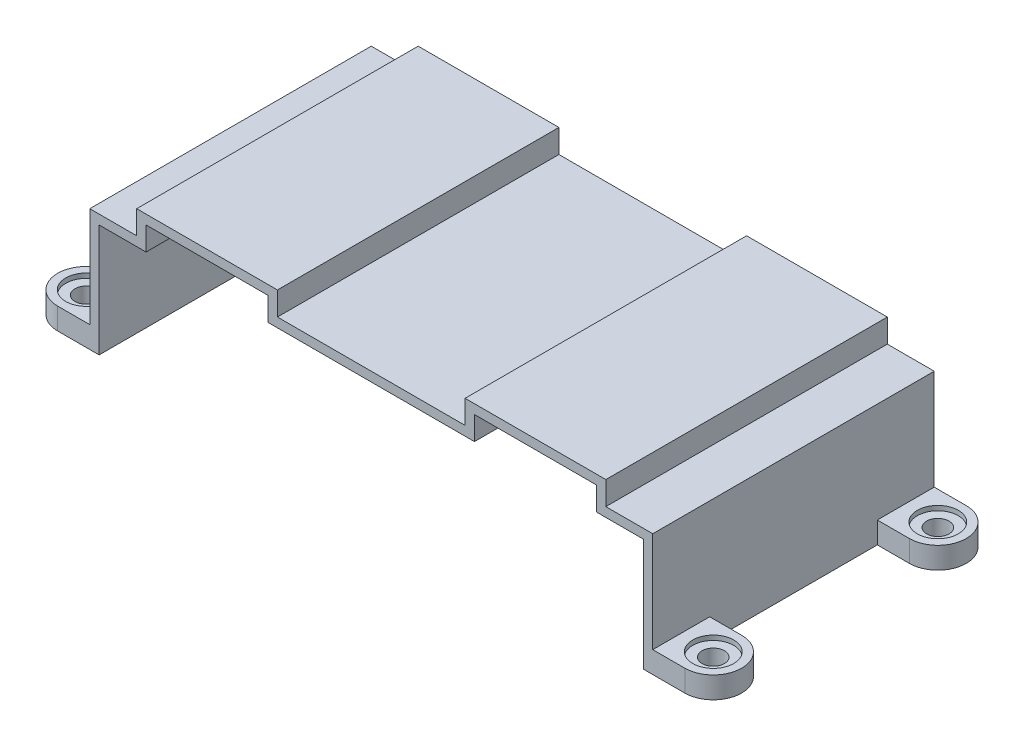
ISO-10303-21;
HEADER;
FILE_DESCRIPTION(('STEP AP214'),'2;1');
FILE_NAME('part.step','',(''),(''),'','','');
FILE_SCHEMA(('AUTOMOTIVE_DESIGN { 1 0 10303 214 1 1 1 1 }'));
ENDSEC;
DATA;
#1=APPLICATION_CONTEXT('core data for automotive mechanical design processes');
#2=APPLICATION_PROTOCOL_DEFINITION('international standard','automotive_design',2000,#1);
#3=PRODUCT_CONTEXT('',#1,'mechanical');
#4=PRODUCT('Part','Part','',(#3));
#5=PRODUCT_RELATED_PRODUCT_CATEGORY('part','',(#4));
#6=PRODUCT_DEFINITION_FORMATION('','',#4);
#7=PRODUCT_DEFINITION_CONTEXT('part definition',#1,'design');
#8=PRODUCT_DEFINITION('design','',#6,#7);
#9=PRODUCT_DEFINITION_SHAPE('','',#8);
#10=(LENGTH_UNIT() NAMED_UNIT(*) SI_UNIT(.MILLI.,.METRE.));
#11=(NAMED_UNIT(*) PLANE_ANGLE_UNIT() SI_UNIT($,.RADIAN.));
#12=(NAMED_UNIT(*) SI_UNIT($,.STERADIAN.) SOLID_ANGLE_UNIT());
#13=UNCERTAINTY_MEASURE_WITH_UNIT(LENGTH_MEASURE(1.E-05),#10,'distance_accuracy_value','');
#14=(GEOMETRIC_REPRESENTATION_CONTEXT(3) GLOBAL_UNCERTAINTY_ASSIGNED_CONTEXT((#13)) GLOBAL_UNIT_ASSIGNED_CONTEXT((#10,
#11,#12)) REPRESENTATION_CONTEXT('',''));
#15=CARTESIAN_POINT('',(0.,0.,0.));
#16=DIRECTION('',(0.,0.,1.));
#17=DIRECTION('',(1.,0.,0.));
#18=AXIS2_PLACEMENT_3D('',#15,#16,#17);
#19=CARTESIAN_POINT('',(-84.8733534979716,5.84200000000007,7.70474442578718));
#20=DIRECTION('',(0.,1.,0.));
#21=DIRECTION('',(-1.,0.,0.));
#22=AXIS2_PLACEMENT_3D('',#19,#20,#21);
#23=PLANE('',#22);
#24=DIRECTION('',(0.,0.,-1.));
#25=VECTOR('',#24,1.);
#26=CARTESIAN_POINT('',(-76.2,5.84200000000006,0.));
#27=LINE('',#26,#25);
#28=CARTESIAN_POINT('',(-76.2,5.84200000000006,15.4094888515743));
#29=VERTEX_POINT('',#28);
#30=CARTESIAN_POINT('',(-76.2,5.84200000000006,0.));
#31=VERTEX_POINT('',#30);
#32=EDGE_CURVE('E319',#29,#31,#27,.T.);
#33=ORIENTED_EDGE('',*,*,#32,.T.);
#34=DIRECTION('',(-1.,0.,0.));
#35=VECTOR('',#34,1.);
#36=CARTESIAN_POINT('',(-76.2,5.84200000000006,0.));
#37=LINE('',#36,#35);
#38=CARTESIAN_POINT('',(-84.8733534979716,5.84200000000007,0.));
#39=VERTEX_POINT('',#38);
#40=EDGE_CURVE('E328',#31,#39,#37,.T.);
#41=ORIENTED_EDGE('',*,*,#40,.T.);
#42=CARTESIAN_POINT('',(-84.8733534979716,5.84200000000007,7.70474442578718));
#43=DIRECTION('',(0.,1.,0.));
#44=DIRECTION('',(-1.,0.,0.));
#45=AXIS2_PLACEMENT_3D('',#42,#43,#44);
#46=CIRCLE('',#45,7.70474442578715);
#47=CARTESIAN_POINT('',(-84.8733534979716,5.84200000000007,15.4094888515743));
#48=VERTEX_POINT('',#47);
#49=EDGE_CURVE('E326',#39,#48,#46,.T.);
#50=ORIENTED_EDGE('',*,*,#49,.T.);
#51=DIRECTION('',(1.,0.,0.));
#52=VECTOR('',#51,1.);
#53=CARTESIAN_POINT('',(-76.2,5.84200000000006,15.4094888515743));
#54=LINE('',#53,#52);
#55=EDGE_CURVE('E322',#48,#29,#54,.T.);
#56=ORIENTED_EDGE('',*,*,#55,.T.);
#57=EDGE_LOOP('',(#33,#41,#50,#56));
#58=FACE_BOUND('',#57,.T.);
#59=CARTESIAN_POINT('',(-84.8733534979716,5.84200000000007,7.70474442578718));
#60=DIRECTION('',(0.,-1.,0.));
#61=DIRECTION('',(-1.,0.,0.));
#62=AXIS2_PLACEMENT_3D('',#59,#60,#61);
#63=CIRCLE('',#62,5.53458428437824);
#64=CARTESIAN_POINT('',(-90.4079377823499,5.84200000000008,7.70474442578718));
#65=VERTEX_POINT('',#64);
#66=EDGE_CURVE('E312',#65,#65,#63,.T.);
#67=ORIENTED_EDGE('',*,*,#66,.T.);
#68=EDGE_LOOP('',(#67));
#69=FACE_BOUND('',#68,.T.);
#70=ADVANCED_FACE('F31',(#58,#69),#23,.T.);
#71=CARTESIAN_POINT('',(-76.2,33.02,76.2));
#72=DIRECTION('',(1.,0.,0.));
#73=DIRECTION('',(0.,1.,0.));
#74=AXIS2_PLACEMENT_3D('',#71,#72,#73);
#75=PLANE('',#74);
#76=DIRECTION('',(0.,-1.,0.));
#77=VECTOR('',#76,1.);
#78=CARTESIAN_POINT('',(-76.2,5.84200000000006,15.4094888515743));
#79=LINE('',#78,#77);
#80=CARTESIAN_POINT('',(-76.2,0.,15.4094888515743));
#81=VERTEX_POINT('',#80);
#82=EDGE_CURVE('E330',#29,#81,#79,.T.);
#83=ORIENTED_EDGE('',*,*,#82,.T.);
#84=DIRECTION('',(0.,0.,-1.));
#85=VECTOR('',#84,1.);
#86=CARTESIAN_POINT('',(-76.2,0.,76.2));
#87=LINE('',#86,#85);
#88=CARTESIAN_POINT('',(-76.2,0.,60.7905111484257));
#89=VERTEX_POINT('',#88);
#90=EDGE_CURVE('E439',#89,#81,#87,.T.);
#91=ORIENTED_EDGE('',*,*,#90,.F.);
#92=DIRECTION('',(0.,-1.,0.));
#93=VECTOR('',#92,1.);
#94=CARTESIAN_POINT('',(-76.2,5.84200000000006,60.7905111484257));
#95=LINE('',#94,#93);
#96=CARTESIAN_POINT('',(-76.2,5.84200000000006,60.7905111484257));
#97=VERTEX_POINT('',#96);
#98=EDGE_CURVE('E627',#97,#89,#95,.T.);
#99=ORIENTED_EDGE('',*,*,#98,.F.);
#100=DIRECTION('',(0.,0.,1.));
#101=VECTOR('',#100,1.);
#102=CARTESIAN_POINT('',(-76.2,5.84200000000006,76.2));
#103=LINE('',#102,#101);
#104=CARTESIAN_POINT('',(-76.2,5.84200000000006,76.2));
#105=VERTEX_POINT('',#104);
#106=EDGE_CURVE('E623',#97,#105,#103,.T.);
#107=ORIENTED_EDGE('',*,*,#106,.T.);
#108=DIRECTION('',(0.,-1.,0.));
#109=VECTOR('',#108,1.);
#110=CARTESIAN_POINT('',(-76.2,33.02,76.2));
#111=LINE('',#110,#109);
#112=CARTESIAN_POINT('',(-76.2,33.02,76.2));
#113=VERTEX_POINT('',#112);
#114=EDGE_CURVE('E456',#113,#105,#111,.T.);
#115=ORIENTED_EDGE('',*,*,#114,.F.);
#116=DIRECTION('',(0.,0.,-1.));
#117=VECTOR('',#116,1.);
#118=CARTESIAN_POINT('',(-76.2,33.02,76.2));
#119=LINE('',#118,#117);
#120=CARTESIAN_POINT('',(-76.2,33.02,0.));
#121=VERTEX_POINT('',#120);
#122=EDGE_CURVE('E444',#113,#121,#119,.T.);
#123=ORIENTED_EDGE('',*,*,#122,.T.);
#124=DIRECTION('',(0.,-1.,0.));
#125=VECTOR('',#124,1.);
#126=CARTESIAN_POINT('',(-76.2,33.02,0.));
#127=LINE('',#126,#125);
#128=EDGE_CURVE('E498',#121,#31,#127,.T.);
#129=ORIENTED_EDGE('',*,*,#128,.T.);
#130=ORIENTED_EDGE('',*,*,#32,.F.);
#131=EDGE_LOOP('',(#83,#91,#99,#107,#115,#123,#129,#130));
#132=FACE_BOUND('',#131,.T.);
#133=ADVANCED_FACE('F409',(#132),#75,.F.);
#134=CARTESIAN_POINT('',(84.8733534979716,5.84200000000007,68.4952555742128));
#135=DIRECTION('',(0.,1.,0.));
#136=DIRECTION('',(1.,0.,0.));
#137=AXIS2_PLACEMENT_3D('',#134,#135,#136);
#138=PLANE('',#137);
#139=DIRECTION('',(0.,0.,1.));
#140=VECTOR('',#139,1.);
#141=CARTESIAN_POINT('',(76.2,5.84200000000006,76.2));
#142=LINE('',#141,#140);
#143=CARTESIAN_POINT('',(76.2,5.84200000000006,60.7905111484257));
#144=VERTEX_POINT('',#143);
#145=CARTESIAN_POINT('',(76.2,5.84200000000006,76.2));
#146=VERTEX_POINT('',#145);
#147=EDGE_CURVE('E355',#144,#146,#142,.T.);
#148=ORIENTED_EDGE('',*,*,#147,.T.);
#149=DIRECTION('',(1.,0.,0.));
#150=VECTOR('',#149,1.);
#151=CARTESIAN_POINT('',(76.2,5.84200000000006,76.2));
#152=LINE('',#151,#150);
#153=CARTESIAN_POINT('',(84.8733534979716,5.84200000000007,76.2));
#154=VERTEX_POINT('',#153);
#155=EDGE_CURVE('E357',#146,#154,#152,.T.);
#156=ORIENTED_EDGE('',*,*,#155,.T.);
#157=CARTESIAN_POINT('',(84.8733534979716,5.84200000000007,68.4952555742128));
#158=DIRECTION('',(0.,1.,0.));
#159=DIRECTION('',(1.,0.,0.));
#160=AXIS2_PLACEMENT_3D('',#157,#158,#159);
#161=CIRCLE('',#160,7.70474442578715);
#162=CARTESIAN_POINT('',(84.8733534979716,5.84200000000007,60.7905111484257));
#163=VERTEX_POINT('',#162);
#164=EDGE_CURVE('E354',#154,#163,#161,.T.);
#165=ORIENTED_EDGE('',*,*,#164,.T.);
#166=DIRECTION('',(-1.,0.,0.));
#167=VECTOR('',#166,1.);
#168=CARTESIAN_POINT('',(76.2,5.84200000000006,60.7905111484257));
#169=LINE('',#168,#167);
#170=EDGE_CURVE('E352',#163,#144,#169,.T.);
#171=ORIENTED_EDGE('',*,*,#170,.T.);
#172=EDGE_LOOP('',(#148,#156,#165,#171));
#173=FACE_BOUND('',#172,.T.);
#174=CARTESIAN_POINT('',(84.8733534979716,5.84200000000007,68.4952555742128));
#175=DIRECTION('',(0.,-1.,0.));
#176=DIRECTION('',(1.,0.,0.));
#177=AXIS2_PLACEMENT_3D('',#174,#175,#176);
#178=CIRCLE('',#177,5.53458428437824);
#179=CARTESIAN_POINT('',(90.4079377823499,5.84200000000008,68.4952555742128));
#180=VERTEX_POINT('',#179);
#181=EDGE_CURVE('E349',#180,#180,#178,.T.);
#182=ORIENTED_EDGE('',*,*,#181,.T.);
#183=EDGE_LOOP('',(#182));
#184=FACE_BOUND('',#183,.T.);
#185=ADVANCED_FACE('F415',(#173,#184),#138,.T.);
#186=CARTESIAN_POINT('',(76.2,33.02,76.2));
#187=DIRECTION('',(-1.,0.,0.));
#188=DIRECTION('',(0.,-1.,0.));
#189=AXIS2_PLACEMENT_3D('',#186,#187,#188);
#190=PLANE('',#189);
#191=DIRECTION('',(0.,0.,-1.));
#192=VECTOR('',#191,1.);
#193=CARTESIAN_POINT('',(76.2,0.,76.2));
#194=LINE('',#193,#192);
#195=CARTESIAN_POINT('',(76.2,0.,60.7905111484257));
#196=VERTEX_POINT('',#195);
#197=CARTESIAN_POINT('',(76.2,0.,15.4094888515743));
#198=VERTEX_POINT('',#197);
#199=EDGE_CURVE('E53',#196,#198,#194,.T.);
#200=ORIENTED_EDGE('',*,*,#199,.T.);
#201=DIRECTION('',(0.,-1.,0.));
#202=VECTOR('',#201,1.);
#203=CARTESIAN_POINT('',(76.2,5.84200000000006,15.4094888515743));
#204=LINE('',#203,#202);
#205=CARTESIAN_POINT('',(76.2,5.84200000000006,15.4094888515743));
#206=VERTEX_POINT('',#205);
#207=EDGE_CURVE('E48',#206,#198,#204,.T.);
#208=ORIENTED_EDGE('',*,*,#207,.F.);
#209=DIRECTION('',(0.,0.,-1.));
#210=VECTOR('',#209,1.);
#211=CARTESIAN_POINT('',(76.2,5.84200000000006,0.));
#212=LINE('',#211,#210);
#213=CARTESIAN_POINT('',(76.2,5.84200000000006,0.));
#214=VERTEX_POINT('',#213);
#215=EDGE_CURVE('E278',#206,#214,#212,.T.);
#216=ORIENTED_EDGE('',*,*,#215,.T.);
#217=DIRECTION('',(0.,1.,0.));
#218=VECTOR('',#217,1.);
#219=CARTESIAN_POINT('',(76.2,33.02,0.));
#220=LINE('',#219,#218);
#221=CARTESIAN_POINT('',(76.2,33.02,0.));
#222=VERTEX_POINT('',#221);
#223=EDGE_CURVE('E266',#214,#222,#220,.T.);
#224=ORIENTED_EDGE('',*,*,#223,.T.);
#225=DIRECTION('',(0.,0.,-1.));
#226=VECTOR('',#225,1.);
#227=CARTESIAN_POINT('',(76.2,33.02,76.2));
#228=LINE('',#227,#226);
#229=CARTESIAN_POINT('',(76.2,33.02,76.2));
#230=VERTEX_POINT('',#229);
#231=EDGE_CURVE('E536',#230,#222,#228,.T.);
#232=ORIENTED_EDGE('',*,*,#231,.F.);
#233=DIRECTION('',(0.,1.,0.));
#234=VECTOR('',#233,1.);
#235=CARTESIAN_POINT('',(76.2,33.02,76.2));
#236=LINE('',#235,#234);
#237=EDGE_CURVE('E614',#146,#230,#236,.T.);
#238=ORIENTED_EDGE('',*,*,#237,.F.);
#239=ORIENTED_EDGE('',*,*,#147,.F.);
#240=DIRECTION('',(0.,-1.,0.));
#241=VECTOR('',#240,1.);
#242=CARTESIAN_POINT('',(76.2,5.84200000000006,60.7905111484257));
#243=LINE('',#242,#241);
#244=EDGE_CURVE('E367',#144,#196,#243,.T.);
#245=ORIENTED_EDGE('',*,*,#244,.T.);
#246=EDGE_LOOP('',(#200,#208,#216,#224,#232,#238,#239,#245));
#247=FACE_BOUND('',#246,.T.);
#248=ADVANCED_FACE('F279',(#247),#190,.F.);
#249=CARTESIAN_POINT('',(25.4,39.37,76.2));
#250=DIRECTION('',(0.,-1.,0.));
#251=DIRECTION('',(0.,0.,-1.));
#252=AXIS2_PLACEMENT_3D('',#249,#250,#251);
#253=PLANE('',#252);
#254=DIRECTION('',(-1.,0.,0.));
#255=VECTOR('',#254,1.);
#256=CARTESIAN_POINT('',(25.4,39.37,0.));
#257=LINE('',#256,#255);
#258=CARTESIAN_POINT('',(63.5,39.37,0.));
#259=VERTEX_POINT('',#258);
#260=CARTESIAN_POINT('',(25.4,39.37,0.));
#261=VERTEX_POINT('',#260);
#262=EDGE_CURVE('E489',#259,#261,#257,.T.);
#263=ORIENTED_EDGE('',*,*,#262,.T.);
#264=DIRECTION('',(0.,0.,-1.));
#265=VECTOR('',#264,1.);
#266=CARTESIAN_POINT('',(25.4,39.37,76.2));
#267=LINE('',#266,#265);
#268=CARTESIAN_POINT('',(25.4,39.37,76.2));
#269=VERTEX_POINT('',#268);
#270=EDGE_CURVE('E11',#269,#261,#267,.T.);
#271=ORIENTED_EDGE('',*,*,#270,.F.);
#272=DIRECTION('',(-1.,0.,0.));
#273=VECTOR('',#272,1.);
#274=CARTESIAN_POINT('',(25.4,39.37,76.2));
#275=LINE('',#274,#273);
#276=CARTESIAN_POINT('',(63.5,39.37,76.2));
#277=VERTEX_POINT('',#276);
#278=EDGE_CURVE('E528',#277,#269,#275,.T.);
#279=ORIENTED_EDGE('',*,*,#278,.F.);
#280=DIRECTION('',(0.,0.,-1.));
#281=VECTOR('',#280,1.);
#282=CARTESIAN_POINT('',(63.5,39.37,76.2));
#283=LINE('',#282,#281);
#284=EDGE_CURVE('E529',#277,#259,#283,.T.);
#285=ORIENTED_EDGE('',*,*,#284,.T.);
#286=EDGE_LOOP('',(#263,#271,#279,#285));
#287=FACE_BOUND('',#286,.T.);
#288=ADVANCED_FACE('F33',(#287),#253,.F.);
#289=CARTESIAN_POINT('',(25.4,33.02,76.2));
#290=DIRECTION('',(1.,0.,0.));
#291=DIRECTION('',(0.,0.,-1.));
#292=AXIS2_PLACEMENT_3D('',#289,#290,#291);
#293=PLANE('',#292);
#294=DIRECTION('',(0.,-1.,0.));
#295=VECTOR('',#294,1.);
#296=CARTESIAN_POINT('',(25.4,33.02,0.));
#297=LINE('',#296,#295);
#298=CARTESIAN_POINT('',(25.4,33.02,0.));
#299=VERTEX_POINT('',#298);
#300=EDGE_CURVE('E483',#261,#299,#297,.T.);
#301=ORIENTED_EDGE('',*,*,#300,.T.);
#302=DIRECTION('',(0.,0.,-1.));
#303=VECTOR('',#302,1.);
#304=CARTESIAN_POINT('',(25.4,33.02,76.2));
#305=LINE('',#304,#303);
#306=CARTESIAN_POINT('',(25.4,33.02,76.2));
#307=VERTEX_POINT('',#306);
#308=EDGE_CURVE('E40',#307,#299,#305,.T.);
#309=ORIENTED_EDGE('',*,*,#308,.F.);
#310=DIRECTION('',(0.,-1.,0.));
#311=VECTOR('',#310,1.);
#312=CARTESIAN_POINT('',(25.4,33.02,76.2));
#313=LINE('',#312,#311);
#314=EDGE_CURVE('E655',#269,#307,#313,.T.);
#315=ORIENTED_EDGE('',*,*,#314,.F.);
#316=ORIENTED_EDGE('',*,*,#270,.T.);
#317=EDGE_LOOP('',(#301,#309,#315,#316));
#318=FACE_BOUND('',#317,.T.);
#319=ADVANCED_FACE('F699',(#318),#293,.F.);
#320=CARTESIAN_POINT('',(-25.4,33.02,76.2));
#321=DIRECTION('',(0.,-1.,0.));
#322=DIRECTION('',(1.,0.,0.));
#323=AXIS2_PLACEMENT_3D('',#320,#321,#322);
#324=PLANE('',#323);
#325=DIRECTION('',(-1.,0.,0.));
#326=VECTOR('',#325,1.);
#327=CARTESIAN_POINT('',(-25.4,33.02,0.));
#328=LINE('',#327,#326);
#329=CARTESIAN_POINT('',(-25.4,33.02,0.));
#330=VERTEX_POINT('',#329);
#331=EDGE_CURVE('E479',#299,#330,#328,.T.);
#332=ORIENTED_EDGE('',*,*,#331,.T.);
#333=DIRECTION('',(0.,0.,-1.));
#334=VECTOR('',#333,1.);
#335=CARTESIAN_POINT('',(-25.4,33.02,76.2));
#336=LINE('',#335,#334);
#337=CARTESIAN_POINT('',(-25.4,33.02,76.2));
#338=VERTEX_POINT('',#337);
#339=EDGE_CURVE('E470',#338,#330,#336,.T.);
#340=ORIENTED_EDGE('',*,*,#339,.F.);
#341=DIRECTION('',(-1.,0.,0.));
#342=VECTOR('',#341,1.);
#343=CARTESIAN_POINT('',(-25.4,33.02,76.2));
#344=LINE('',#343,#342);
#345=EDGE_CURVE('E480',#307,#338,#344,.T.);
#346=ORIENTED_EDGE('',*,*,#345,.F.);
#347=ORIENTED_EDGE('',*,*,#308,.T.);
#348=EDGE_LOOP('',(#332,#340,#346,#347));
#349=FACE_BOUND('',#348,.T.);
#350=ADVANCED_FACE('F477',(#349),#324,.F.);
#351=CARTESIAN_POINT('',(-25.4,33.02,76.2));
#352=DIRECTION('',(-1.,0.,0.));
#353=DIRECTION('',(0.,0.,1.));
#354=AXIS2_PLACEMENT_3D('',#351,#352,#353);
#355=PLANE('',#354);
#356=DIRECTION('',(0.,1.,0.));
#357=VECTOR('',#356,1.);
#358=CARTESIAN_POINT('',(-25.4,33.02,0.));
#359=LINE('',#358,#357);
#360=CARTESIAN_POINT('',(-25.4,39.37,0.));
#361=VERTEX_POINT('',#360);
#362=EDGE_CURVE('E485',#330,#361,#359,.T.);
#363=ORIENTED_EDGE('',*,*,#362,.T.);
#364=DIRECTION('',(0.,0.,-1.));
#365=VECTOR('',#364,1.);
#366=CARTESIAN_POINT('',(-25.4,39.37,76.2));
#367=LINE('',#366,#365);
#368=CARTESIAN_POINT('',(-25.4,39.37,76.2));
#369=VERTEX_POINT('',#368);
#370=EDGE_CURVE('E467',#369,#361,#367,.T.);
#371=ORIENTED_EDGE('',*,*,#370,.F.);
#372=DIRECTION('',(0.,1.,0.));
#373=VECTOR('',#372,1.);
#374=CARTESIAN_POINT('',(-25.4,33.02,76.2));
#375=LINE('',#374,#373);
#376=EDGE_CURVE('E658',#338,#369,#375,.T.);
#377=ORIENTED_EDGE('',*,*,#376,.F.);
#378=ORIENTED_EDGE('',*,*,#339,.T.);
#379=EDGE_LOOP('',(#363,#371,#377,#378));
#380=FACE_BOUND('',#379,.T.);
#381=ADVANCED_FACE('F696',(#380),#355,.F.);
#382=CARTESIAN_POINT('',(-63.5,39.37,76.2));
#383=DIRECTION('',(0.,-1.,0.));
#384=DIRECTION('',(1.,0.,0.));
#385=AXIS2_PLACEMENT_3D('',#382,#383,#384);
#386=PLANE('',#385);
#387=DIRECTION('',(-1.,0.,0.));
#388=VECTOR('',#387,1.);
#389=CARTESIAN_POINT('',(-63.5,39.37,0.));
#390=LINE('',#389,#388);
#391=CARTESIAN_POINT('',(-63.5,39.37,0.));
#392=VERTEX_POINT('',#391);
#393=EDGE_CURVE('E487',#361,#392,#390,.T.);
#394=ORIENTED_EDGE('',*,*,#393,.T.);
#395=DIRECTION('',(0.,0.,-1.));
#396=VECTOR('',#395,1.);
#397=CARTESIAN_POINT('',(-63.5,39.37,76.2));
#398=LINE('',#397,#396);
#399=CARTESIAN_POINT('',(-63.5,39.37,76.2));
#400=VERTEX_POINT('',#399);
#401=EDGE_CURVE('E464',#400,#392,#398,.T.);
#402=ORIENTED_EDGE('',*,*,#401,.F.);
#403=DIRECTION('',(-1.,0.,0.));
#404=VECTOR('',#403,1.);
#405=CARTESIAN_POINT('',(-63.5,39.37,76.2));
#406=LINE('',#405,#404);
#407=EDGE_CURVE('E660',#369,#400,#406,.T.);
#408=ORIENTED_EDGE('',*,*,#407,.F.);
#409=ORIENTED_EDGE('',*,*,#370,.T.);
#410=EDGE_LOOP('',(#394,#402,#408,#409));
#411=FACE_BOUND('',#410,.T.);
#412=ADVANCED_FACE('F691',(#411),#386,.F.);
#413=CARTESIAN_POINT('',(-63.5,39.37,76.2));
#414=DIRECTION('',(1.,0.,0.));
#415=DIRECTION('',(0.,0.,-1.));
#416=AXIS2_PLACEMENT_3D('',#413,#414,#415);
#417=PLANE('',#416);
#418=DIRECTION('',(0.,-1.,0.));
#419=VECTOR('',#418,1.);
#420=CARTESIAN_POINT('',(-63.5,39.37,0.));
#421=LINE('',#420,#419);
#422=CARTESIAN_POINT('',(-63.5,33.02,0.));
#423=VERTEX_POINT('',#422);
#424=EDGE_CURVE('E494',#392,#423,#421,.T.);
#425=ORIENTED_EDGE('',*,*,#424,.T.);
#426=DIRECTION('',(0.,0.,-1.));
#427=VECTOR('',#426,1.);
#428=CARTESIAN_POINT('',(-63.5,33.02,76.2));
#429=LINE('',#428,#427);
#430=CARTESIAN_POINT('',(-63.5,33.02,76.2));
#431=VERTEX_POINT('',#430);
#432=EDGE_CURVE('E448',#431,#423,#429,.T.);
#433=ORIENTED_EDGE('',*,*,#432,.F.);
#434=DIRECTION('',(0.,-1.,0.));
#435=VECTOR('',#434,1.);
#436=CARTESIAN_POINT('',(-63.5,39.37,76.2));
#437=LINE('',#436,#435);
#438=EDGE_CURVE('E662',#400,#431,#437,.T.);
#439=ORIENTED_EDGE('',*,*,#438,.F.);
#440=ORIENTED_EDGE('',*,*,#401,.T.);
#441=EDGE_LOOP('',(#425,#433,#439,#440));
#442=FACE_BOUND('',#441,.T.);
#443=ADVANCED_FACE('F688',(#442),#417,.F.);
#444=CARTESIAN_POINT('',(-76.2,33.02,76.2));
#445=DIRECTION('',(0.,-1.,0.));
#446=DIRECTION('',(0.,0.,-1.));
#447=AXIS2_PLACEMENT_3D('',#444,#445,#446);
#448=PLANE('',#447);
#449=DIRECTION('',(-1.,0.,0.));
#450=VECTOR('',#449,1.);
#451=CARTESIAN_POINT('',(-76.2,33.02,0.));
#452=LINE('',#451,#450);
#453=EDGE_CURVE('E496',#423,#121,#452,.T.);
#454=ORIENTED_EDGE('',*,*,#453,.T.);
#455=ORIENTED_EDGE('',*,*,#122,.F.);
#456=DIRECTION('',(-1.,0.,0.));
#457=VECTOR('',#456,1.);
#458=CARTESIAN_POINT('',(-76.2,33.02,76.2));
#459=LINE('',#458,#457);
#460=EDGE_CURVE('E664',#431,#113,#459,.T.);
#461=ORIENTED_EDGE('',*,*,#460,.F.);
#462=ORIENTED_EDGE('',*,*,#432,.T.);
#463=EDGE_LOOP('',(#454,#455,#461,#462));
#464=FACE_BOUND('',#463,.T.);
#465=ADVANCED_FACE('F684',(#464),#448,.F.);
#466=CARTESIAN_POINT('',(-76.2,0.,76.2));
#467=DIRECTION('',(0.,1.,0.));
#468=DIRECTION('',(-1.,0.,0.));
#469=AXIS2_PLACEMENT_3D('',#466,#467,#468);
#470=PLANE('',#469);
#471=CARTESIAN_POINT('',(-84.8733534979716,0.,7.70474442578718));
#472=DIRECTION('',(0.,1.,0.));
#473=DIRECTION('',(-1.,0.,0.));
#474=AXIS2_PLACEMENT_3D('',#471,#472,#473);
#475=CIRCLE('',#474,3.02259999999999);
#476=CARTESIAN_POINT('',(-87.8959534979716,0.,7.70474442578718));
#477=VERTEX_POINT('',#476);
#478=EDGE_CURVE('E309',#477,#477,#475,.T.);
#479=ORIENTED_EDGE('',*,*,#478,.T.);
#480=EDGE_LOOP('',(#479));
#481=FACE_BOUND('',#480,.T.);
#482=CARTESIAN_POINT('',(-84.8733534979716,0.,68.4952555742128));
#483=DIRECTION('',(0.,1.,0.));
#484=DIRECTION('',(-1.,0.,0.));
#485=AXIS2_PLACEMENT_3D('',#482,#483,#484);
#486=CIRCLE('',#485,3.02259999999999);
#487=CARTESIAN_POINT('',(-87.8959534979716,0.,68.4952555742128));
#488=VERTEX_POINT('',#487);
#489=EDGE_CURVE('E1032',#488,#488,#486,.T.);
#490=ORIENTED_EDGE('',*,*,#489,.T.);
#491=EDGE_LOOP('',(#490));
#492=FACE_BOUND('',#491,.T.);
#493=DIRECTION('',(1.,0.,0.));
#494=VECTOR('',#493,1.);
#495=CARTESIAN_POINT('',(-76.2,0.,0.));
#496=LINE('',#495,#494);
#497=CARTESIAN_POINT('',(-84.8733534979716,0.,0.));
#498=VERTEX_POINT('',#497);
#499=CARTESIAN_POINT('',(-73.66,0.,0.));
#500=VERTEX_POINT('',#499);
#501=EDGE_CURVE('E500',#498,#500,#496,.T.);
#502=ORIENTED_EDGE('',*,*,#501,.T.);
#503=DIRECTION('',(0.,0.,-1.));
#504=VECTOR('',#503,1.);
#505=CARTESIAN_POINT('',(-73.66,0.,76.2));
#506=LINE('',#505,#504);
#507=CARTESIAN_POINT('',(-73.66,0.,76.2));
#508=VERTEX_POINT('',#507);
#509=EDGE_CURVE('E445',#508,#500,#506,.T.);
#510=ORIENTED_EDGE('',*,*,#509,.F.);
#511=DIRECTION('',(1.,0.,0.));
#512=VECTOR('',#511,1.);
#513=CARTESIAN_POINT('',(-76.2,0.,76.2));
#514=LINE('',#513,#512);
#515=CARTESIAN_POINT('',(-84.8733534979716,0.,76.2));
#516=VERTEX_POINT('',#515);
#517=EDGE_CURVE('E667',#516,#508,#514,.T.);
#518=ORIENTED_EDGE('',*,*,#517,.F.);
#519=CARTESIAN_POINT('',(-84.8733534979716,0.,68.4952555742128));
#520=DIRECTION('',(0.,-1.,0.));
#521=DIRECTION('',(-1.,0.,0.));
#522=AXIS2_PLACEMENT_3D('',#519,#520,#521);
#523=CIRCLE('',#522,7.70474442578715);
#524=CARTESIAN_POINT('',(-84.8733534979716,0.,60.7905111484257));
#525=VERTEX_POINT('',#524);
#526=EDGE_CURVE('E624',#516,#525,#523,.T.);
#527=ORIENTED_EDGE('',*,*,#526,.T.);
#528=DIRECTION('',(1.,0.,0.));
#529=VECTOR('',#528,1.);
#530=CARTESIAN_POINT('',(-76.2,0.,60.7905111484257));
#531=LINE('',#530,#529);
#532=EDGE_CURVE('E442',#525,#89,#531,.T.);
#533=ORIENTED_EDGE('',*,*,#532,.T.);
#534=ORIENTED_EDGE('',*,*,#90,.T.);
#535=DIRECTION('',(1.,0.,0.));
#536=VECTOR('',#535,1.);
#537=CARTESIAN_POINT('',(-76.2,0.,15.4094888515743));
#538=LINE('',#537,#536);
#539=CARTESIAN_POINT('',(-84.8733534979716,0.,15.4094888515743));
#540=VERTEX_POINT('',#539);
#541=EDGE_CURVE('E316',#540,#81,#538,.T.);
#542=ORIENTED_EDGE('',*,*,#541,.F.);
#543=CARTESIAN_POINT('',(-84.8733534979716,0.,7.70474442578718));
#544=DIRECTION('',(0.,1.,0.));
#545=DIRECTION('',(-1.,0.,0.));
#546=AXIS2_PLACEMENT_3D('',#543,#544,#545);
#547=CIRCLE('',#546,7.70474442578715);
#548=EDGE_CURVE('E323',#498,#540,#547,.T.);
#549=ORIENTED_EDGE('',*,*,#548,.F.);
#550=EDGE_LOOP('',(#502,#510,#518,#527,#533,#534,#542,#549));
#551=FACE_BOUND('',#550,.T.);
#552=ADVANCED_FACE('F436',(#481,#492,#551),#470,.F.);
#553=CARTESIAN_POINT('',(-73.66,30.48,76.2));
#554=DIRECTION('',(-1.,0.,0.));
#555=DIRECTION('',(0.,0.,1.));
#556=AXIS2_PLACEMENT_3D('',#553,#554,#555);
#557=PLANE('',#556);
#558=DIRECTION('',(0.,1.,0.));
#559=VECTOR('',#558,1.);
#560=CARTESIAN_POINT('',(-73.66,30.48,0.));
#561=LINE('',#560,#559);
#562=CARTESIAN_POINT('',(-73.66,30.48,0.));
#563=VERTEX_POINT('',#562);
#564=EDGE_CURVE('E502',#500,#563,#561,.T.);
#565=ORIENTED_EDGE('',*,*,#564,.T.);
#566=DIRECTION('',(0.,0.,-1.));
#567=VECTOR('',#566,1.);
#568=CARTESIAN_POINT('',(-73.66,30.48,76.2));
#569=LINE('',#568,#567);
#570=CARTESIAN_POINT('',(-73.66,30.48,76.2));
#571=VERTEX_POINT('',#570);
#572=EDGE_CURVE('E451',#571,#563,#569,.T.);
#573=ORIENTED_EDGE('',*,*,#572,.F.);
#574=DIRECTION('',(0.,1.,0.));
#575=VECTOR('',#574,1.);
#576=CARTESIAN_POINT('',(-73.66,30.48,76.2));
#577=LINE('',#576,#575);
#578=EDGE_CURVE('E669',#508,#571,#577,.T.);
#579=ORIENTED_EDGE('',*,*,#578,.F.);
#580=ORIENTED_EDGE('',*,*,#509,.T.);
#581=EDGE_LOOP('',(#565,#573,#579,#580));
#582=FACE_BOUND('',#581,.T.);
#583=ADVANCED_FACE('F672',(#582),#557,.F.);
#584=CARTESIAN_POINT('',(-73.66,30.48,76.2));
#585=DIRECTION('',(0.,1.,0.));
#586=DIRECTION('',(0.,0.,1.));
#587=AXIS2_PLACEMENT_3D('',#584,#585,#586);
#588=PLANE('',#587);
#589=DIRECTION('',(1.,0.,0.));
#590=VECTOR('',#589,1.);
#591=CARTESIAN_POINT('',(-73.66,30.48,0.));
#592=LINE('',#591,#590);
#593=CARTESIAN_POINT('',(-60.96,30.48,0.));
#594=VERTEX_POINT('',#593);
#595=EDGE_CURVE('E504',#563,#594,#592,.T.);
#596=ORIENTED_EDGE('',*,*,#595,.T.);
#597=DIRECTION('',(0.,0.,-1.));
#598=VECTOR('',#597,1.);
#599=CARTESIAN_POINT('',(-60.96,30.48,76.2));
#600=LINE('',#599,#598);
#601=CARTESIAN_POINT('',(-60.96,30.48,76.2));
#602=VERTEX_POINT('',#601);
#603=EDGE_CURVE('E566',#602,#594,#600,.T.);
#604=ORIENTED_EDGE('',*,*,#603,.F.);
#605=DIRECTION('',(1.,0.,0.));
#606=VECTOR('',#605,1.);
#607=CARTESIAN_POINT('',(-73.66,30.48,76.2));
#608=LINE('',#607,#606);
#609=EDGE_CURVE('E575',#571,#602,#608,.T.);
#610=ORIENTED_EDGE('',*,*,#609,.F.);
#611=ORIENTED_EDGE('',*,*,#572,.T.);
#612=EDGE_LOOP('',(#596,#604,#610,#611));
#613=FACE_BOUND('',#612,.T.);
#614=ADVANCED_FACE('F573',(#613),#588,.F.);
#615=CARTESIAN_POINT('',(-60.96,36.83,76.2));
#616=DIRECTION('',(-1.,0.,0.));
#617=DIRECTION('',(0.,0.,1.));
#618=AXIS2_PLACEMENT_3D('',#615,#616,#617);
#619=PLANE('',#618);
#620=DIRECTION('',(0.,1.,0.));
#621=VECTOR('',#620,1.);
#622=CARTESIAN_POINT('',(-60.96,36.83,0.));
#623=LINE('',#622,#621);
#624=CARTESIAN_POINT('',(-60.96,36.83,0.));
#625=VERTEX_POINT('',#624);
#626=EDGE_CURVE('E506',#594,#625,#623,.T.);
#627=ORIENTED_EDGE('',*,*,#626,.T.);
#628=DIRECTION('',(0.,0.,-1.));
#629=VECTOR('',#628,1.);
#630=CARTESIAN_POINT('',(-60.96,36.83,76.2));
#631=LINE('',#630,#629);
#632=CARTESIAN_POINT('',(-60.96,36.83,76.2));
#633=VERTEX_POINT('',#632);
#634=EDGE_CURVE('E563',#633,#625,#631,.T.);
#635=ORIENTED_EDGE('',*,*,#634,.F.);
#636=DIRECTION('',(0.,1.,0.));
#637=VECTOR('',#636,1.);
#638=CARTESIAN_POINT('',(-60.96,36.83,76.2));
#639=LINE('',#638,#637);
#640=EDGE_CURVE('E594',#602,#633,#639,.T.);
#641=ORIENTED_EDGE('',*,*,#640,.F.);
#642=ORIENTED_EDGE('',*,*,#603,.T.);
#643=EDGE_LOOP('',(#627,#635,#641,#642));
#644=FACE_BOUND('',#643,.T.);
#645=ADVANCED_FACE('F584',(#644),#619,.F.);
#646=CARTESIAN_POINT('',(-60.96,36.83,76.2));
#647=DIRECTION('',(0.,1.,0.));
#648=DIRECTION('',(-1.,0.,0.));
#649=AXIS2_PLACEMENT_3D('',#646,#647,#648);
#650=PLANE('',#649);
#651=DIRECTION('',(1.,0.,0.));
#652=VECTOR('',#651,1.);
#653=CARTESIAN_POINT('',(-60.96,36.83,0.));
#654=LINE('',#653,#652);
#655=CARTESIAN_POINT('',(-27.94,36.83,0.));
#656=VERTEX_POINT('',#655);
#657=EDGE_CURVE('E508',#625,#656,#654,.T.);
#658=ORIENTED_EDGE('',*,*,#657,.T.);
#659=DIRECTION('',(0.,0.,-1.));
#660=VECTOR('',#659,1.);
#661=CARTESIAN_POINT('',(-27.94,36.83,76.2));
#662=LINE('',#661,#660);
#663=CARTESIAN_POINT('',(-27.94,36.83,76.2));
#664=VERTEX_POINT('',#663);
#665=EDGE_CURVE('E560',#664,#656,#662,.T.);
#666=ORIENTED_EDGE('',*,*,#665,.F.);
#667=DIRECTION('',(1.,0.,0.));
#668=VECTOR('',#667,1.);
#669=CARTESIAN_POINT('',(-60.96,36.83,76.2));
#670=LINE('',#669,#668);
#671=EDGE_CURVE('E590',#633,#664,#670,.T.);
#672=ORIENTED_EDGE('',*,*,#671,.F.);
#673=ORIENTED_EDGE('',*,*,#634,.T.);
#674=EDGE_LOOP('',(#658,#666,#672,#673));
#675=FACE_BOUND('',#674,.T.);
#676=ADVANCED_FACE('F588',(#675),#650,.F.);
#677=CARTESIAN_POINT('',(-27.94,30.48,76.2));
#678=DIRECTION('',(1.,0.,0.));
#679=DIRECTION('',(0.,0.,-1.));
#680=AXIS2_PLACEMENT_3D('',#677,#678,#679);
#681=PLANE('',#680);
#682=DIRECTION('',(0.,-1.,0.));
#683=VECTOR('',#682,1.);
#684=CARTESIAN_POINT('',(-27.94,30.48,0.));
#685=LINE('',#684,#683);
#686=CARTESIAN_POINT('',(-27.94,30.48,0.));
#687=VERTEX_POINT('',#686);
#688=EDGE_CURVE('E510',#656,#687,#685,.T.);
#689=ORIENTED_EDGE('',*,*,#688,.T.);
#690=DIRECTION('',(0.,0.,-1.));
#691=VECTOR('',#690,1.);
#692=CARTESIAN_POINT('',(-27.94,30.48,76.2));
#693=LINE('',#692,#691);
#694=CARTESIAN_POINT('',(-27.94,30.48,76.2));
#695=VERTEX_POINT('',#694);
#696=EDGE_CURVE('E557',#695,#687,#693,.T.);
#697=ORIENTED_EDGE('',*,*,#696,.F.);
#698=DIRECTION('',(0.,-1.,0.));
#699=VECTOR('',#698,1.);
#700=CARTESIAN_POINT('',(-27.94,30.48,76.2));
#701=LINE('',#700,#699);
#702=EDGE_CURVE('E593',#664,#695,#701,.T.);
#703=ORIENTED_EDGE('',*,*,#702,.F.);
#704=ORIENTED_EDGE('',*,*,#665,.T.);
#705=EDGE_LOOP('',(#689,#697,#703,#704));
#706=FACE_BOUND('',#705,.T.);
#707=ADVANCED_FACE('F749',(#706),#681,.F.);
#708=CARTESIAN_POINT('',(-27.94,30.48,76.2));
#709=DIRECTION('',(0.,1.,0.));
#710=DIRECTION('',(0.,0.,1.));
#711=AXIS2_PLACEMENT_3D('',#708,#709,#710);
#712=PLANE('',#711);
#713=DIRECTION('',(1.,0.,0.));
#714=VECTOR('',#713,1.);
#715=CARTESIAN_POINT('',(-27.94,30.48,0.));
#716=LINE('',#715,#714);
#717=CARTESIAN_POINT('',(27.94,30.48,0.));
#718=VERTEX_POINT('',#717);
#719=EDGE_CURVE('E512',#687,#718,#716,.T.);
#720=ORIENTED_EDGE('',*,*,#719,.T.);
#721=DIRECTION('',(0.,0.,-1.));
#722=VECTOR('',#721,1.);
#723=CARTESIAN_POINT('',(27.94,30.48,76.2));
#724=LINE('',#723,#722);
#725=CARTESIAN_POINT('',(27.94,30.48,76.2));
#726=VERTEX_POINT('',#725);
#727=EDGE_CURVE('E554',#726,#718,#724,.T.);
#728=ORIENTED_EDGE('',*,*,#727,.F.);
#729=DIRECTION('',(1.,0.,0.));
#730=VECTOR('',#729,1.);
#731=CARTESIAN_POINT('',(-27.94,30.48,76.2));
#732=LINE('',#731,#730);
#733=EDGE_CURVE('E596',#695,#726,#732,.T.);
#734=ORIENTED_EDGE('',*,*,#733,.F.);
#735=ORIENTED_EDGE('',*,*,#696,.T.);
#736=EDGE_LOOP('',(#720,#728,#734,#735));
#737=FACE_BOUND('',#736,.T.);
#738=ADVANCED_FACE('F745',(#737),#712,.F.);
#739=CARTESIAN_POINT('',(27.94,30.48,76.2));
#740=DIRECTION('',(-1.,0.,0.));
#741=DIRECTION('',(0.,0.,1.));
#742=AXIS2_PLACEMENT_3D('',#739,#740,#741);
#743=PLANE('',#742);
#744=DIRECTION('',(0.,1.,0.));
#745=VECTOR('',#744,1.);
#746=CARTESIAN_POINT('',(27.94,30.48,0.));
#747=LINE('',#746,#745);
#748=CARTESIAN_POINT('',(27.94,36.83,0.));
#749=VERTEX_POINT('',#748);
#750=EDGE_CURVE('E514',#718,#749,#747,.T.);
#751=ORIENTED_EDGE('',*,*,#750,.T.);
#752=DIRECTION('',(0.,0.,-1.));
#753=VECTOR('',#752,1.);
#754=CARTESIAN_POINT('',(27.94,36.83,76.2));
#755=LINE('',#754,#753);
#756=CARTESIAN_POINT('',(27.94,36.83,76.2));
#757=VERTEX_POINT('',#756);
#758=EDGE_CURVE('E551',#757,#749,#755,.T.);
#759=ORIENTED_EDGE('',*,*,#758,.F.);
#760=DIRECTION('',(0.,1.,0.));
#761=VECTOR('',#760,1.);
#762=CARTESIAN_POINT('',(27.94,30.48,76.2));
#763=LINE('',#762,#761);
#764=EDGE_CURVE('E602',#726,#757,#763,.T.);
#765=ORIENTED_EDGE('',*,*,#764,.F.);
#766=ORIENTED_EDGE('',*,*,#727,.T.);
#767=EDGE_LOOP('',(#751,#759,#765,#766));
#768=FACE_BOUND('',#767,.T.);
#769=ADVANCED_FACE('F741',(#768),#743,.F.);
#770=CARTESIAN_POINT('',(27.94,36.83,76.2));
#771=DIRECTION('',(0.,1.,0.));
#772=DIRECTION('',(-1.,0.,0.));
#773=AXIS2_PLACEMENT_3D('',#770,#771,#772);
#774=PLANE('',#773);
#775=DIRECTION('',(1.,0.,0.));
#776=VECTOR('',#775,1.);
#777=CARTESIAN_POINT('',(27.94,36.83,0.));
#778=LINE('',#777,#776);
#779=CARTESIAN_POINT('',(60.96,36.83,0.));
#780=VERTEX_POINT('',#779);
#781=EDGE_CURVE('E516',#749,#780,#778,.T.);
#782=ORIENTED_EDGE('',*,*,#781,.T.);
#783=DIRECTION('',(0.,0.,-1.));
#784=VECTOR('',#783,1.);
#785=CARTESIAN_POINT('',(60.96,36.83,76.2));
#786=LINE('',#785,#784);
#787=CARTESIAN_POINT('',(60.96,36.83,76.2));
#788=VERTEX_POINT('',#787);
#789=EDGE_CURVE('E548',#788,#780,#786,.T.);
#790=ORIENTED_EDGE('',*,*,#789,.F.);
#791=DIRECTION('',(1.,0.,0.));
#792=VECTOR('',#791,1.);
#793=CARTESIAN_POINT('',(27.94,36.83,76.2));
#794=LINE('',#793,#792);
#795=EDGE_CURVE('E604',#757,#788,#794,.T.);
#796=ORIENTED_EDGE('',*,*,#795,.F.);
#797=ORIENTED_EDGE('',*,*,#758,.T.);
#798=EDGE_LOOP('',(#782,#790,#796,#797));
#799=FACE_BOUND('',#798,.T.);
#800=ADVANCED_FACE('F737',(#799),#774,.F.);
#801=CARTESIAN_POINT('',(60.96,36.83,76.2));
#802=DIRECTION('',(1.,0.,0.));
#803=DIRECTION('',(0.,0.,-1.));
#804=AXIS2_PLACEMENT_3D('',#801,#802,#803);
#805=PLANE('',#804);
#806=DIRECTION('',(0.,-1.,0.));
#807=VECTOR('',#806,1.);
#808=CARTESIAN_POINT('',(60.96,36.83,0.));
#809=LINE('',#808,#807);
#810=CARTESIAN_POINT('',(60.96,30.48,0.));
#811=VERTEX_POINT('',#810);
#812=EDGE_CURVE('E518',#780,#811,#809,.T.);
#813=ORIENTED_EDGE('',*,*,#812,.T.);
#814=DIRECTION('',(0.,0.,-1.));
#815=VECTOR('',#814,1.);
#816=CARTESIAN_POINT('',(60.96,30.48,76.2));
#817=LINE('',#816,#815);
#818=CARTESIAN_POINT('',(60.96,30.48,76.2));
#819=VERTEX_POINT('',#818);
#820=EDGE_CURVE('E545',#819,#811,#817,.T.);
#821=ORIENTED_EDGE('',*,*,#820,.F.);
#822=DIRECTION('',(0.,-1.,0.));
#823=VECTOR('',#822,1.);
#824=CARTESIAN_POINT('',(60.96,36.83,76.2));
#825=LINE('',#824,#823);
#826=EDGE_CURVE('E606',#788,#819,#825,.T.);
#827=ORIENTED_EDGE('',*,*,#826,.F.);
#828=ORIENTED_EDGE('',*,*,#789,.T.);
#829=EDGE_LOOP('',(#813,#821,#827,#828));
#830=FACE_BOUND('',#829,.T.);
#831=ADVANCED_FACE('F733',(#830),#805,.F.);
#832=CARTESIAN_POINT('',(60.96,30.48,76.2));
#833=DIRECTION('',(0.,1.,0.));
#834=DIRECTION('',(0.,0.,1.));
#835=AXIS2_PLACEMENT_3D('',#832,#833,#834);
#836=PLANE('',#835);
#837=DIRECTION('',(1.,0.,0.));
#838=VECTOR('',#837,1.);
#839=CARTESIAN_POINT('',(60.96,30.48,0.));
#840=LINE('',#839,#838);
#841=CARTESIAN_POINT('',(73.66,30.48,0.));
#842=VERTEX_POINT('',#841);
#843=EDGE_CURVE('E520',#811,#842,#840,.T.);
#844=ORIENTED_EDGE('',*,*,#843,.T.);
#845=DIRECTION('',(0.,0.,-1.));
#846=VECTOR('',#845,1.);
#847=CARTESIAN_POINT('',(73.66,30.48,76.2));
#848=LINE('',#847,#846);
#849=CARTESIAN_POINT('',(73.66,30.48,76.2));
#850=VERTEX_POINT('',#849);
#851=EDGE_CURVE('E542',#850,#842,#848,.T.);
#852=ORIENTED_EDGE('',*,*,#851,.F.);
#853=DIRECTION('',(1.,0.,0.));
#854=VECTOR('',#853,1.);
#855=CARTESIAN_POINT('',(60.96,30.48,76.2));
#856=LINE('',#855,#854);
#857=EDGE_CURVE('E608',#819,#850,#856,.T.);
#858=ORIENTED_EDGE('',*,*,#857,.F.);
#859=ORIENTED_EDGE('',*,*,#820,.T.);
#860=EDGE_LOOP('',(#844,#852,#858,#859));
#861=FACE_BOUND('',#860,.T.);
#862=ADVANCED_FACE('F729',(#861),#836,.F.);
#863=CARTESIAN_POINT('',(73.66,30.48,76.2));
#864=DIRECTION('',(1.,0.,0.));
#865=DIRECTION('',(0.,0.,-1.));
#866=AXIS2_PLACEMENT_3D('',#863,#864,#865);
#867=PLANE('',#866);
#868=DIRECTION('',(0.,-1.,0.));
#869=VECTOR('',#868,1.);
#870=CARTESIAN_POINT('',(73.66,30.48,0.));
#871=LINE('',#870,#869);
#872=CARTESIAN_POINT('',(73.66,0.,0.));
#873=VERTEX_POINT('',#872);
#874=EDGE_CURVE('E522',#842,#873,#871,.T.);
#875=ORIENTED_EDGE('',*,*,#874,.T.);
#876=DIRECTION('',(0.,0.,-1.));
#877=VECTOR('',#876,1.);
#878=CARTESIAN_POINT('',(73.66,0.,76.2));
#879=LINE('',#878,#877);
#880=CARTESIAN_POINT('',(73.66,0.,76.2));
#881=VERTEX_POINT('',#880);
#882=EDGE_CURVE('E539',#881,#873,#879,.T.);
#883=ORIENTED_EDGE('',*,*,#882,.F.);
#884=DIRECTION('',(0.,-1.,0.));
#885=VECTOR('',#884,1.);
#886=CARTESIAN_POINT('',(73.66,30.48,76.2));
#887=LINE('',#886,#885);
#888=EDGE_CURVE('E610',#850,#881,#887,.T.);
#889=ORIENTED_EDGE('',*,*,#888,.F.);
#890=ORIENTED_EDGE('',*,*,#851,.T.);
#891=EDGE_LOOP('',(#875,#883,#889,#890));
#892=FACE_BOUND('',#891,.T.);
#893=ADVANCED_FACE('F725',(#892),#867,.F.);
#894=CARTESIAN_POINT('',(76.2,0.,76.2));
#895=DIRECTION('',(0.,1.,0.));
#896=DIRECTION('',(-1.,0.,0.));
#897=AXIS2_PLACEMENT_3D('',#894,#895,#896);
#898=PLANE('',#897);
#899=CARTESIAN_POINT('',(84.8733534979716,0.,7.70474442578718));
#900=DIRECTION('',(0.,1.,0.));
#901=DIRECTION('',(-1.,0.,0.));
#902=AXIS2_PLACEMENT_3D('',#899,#900,#901);
#903=CIRCLE('',#902,3.02259999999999);
#904=CARTESIAN_POINT('',(81.8507534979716,0.,7.70474442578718));
#905=VERTEX_POINT('',#904);
#906=EDGE_CURVE('E35',#905,#905,#903,.T.);
#907=ORIENTED_EDGE('',*,*,#906,.T.);
#908=EDGE_LOOP('',(#907));
#909=FACE_BOUND('',#908,.T.);
#910=CARTESIAN_POINT('',(84.8733534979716,0.,68.4952555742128));
#911=DIRECTION('',(0.,1.,0.));
#912=DIRECTION('',(-1.,0.,0.));
#913=AXIS2_PLACEMENT_3D('',#910,#911,#912);
#914=CIRCLE('',#913,3.02259999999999);
#915=CARTESIAN_POINT('',(81.8507534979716,0.,68.4952555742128));
#916=VERTEX_POINT('',#915);
#917=EDGE_CURVE('E344',#916,#916,#914,.T.);
#918=ORIENTED_EDGE('',*,*,#917,.T.);
#919=EDGE_LOOP('',(#918));
#920=FACE_BOUND('',#919,.T.);
#921=DIRECTION('',(1.,0.,0.));
#922=VECTOR('',#921,1.);
#923=CARTESIAN_POINT('',(76.2,0.,0.));
#924=LINE('',#923,#922);
#925=CARTESIAN_POINT('',(84.8733534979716,0.,0.));
#926=VERTEX_POINT('',#925);
#927=EDGE_CURVE('E276',#873,#926,#924,.T.);
#928=ORIENTED_EDGE('',*,*,#927,.T.);
#929=CARTESIAN_POINT('',(84.8733534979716,0.,7.70474442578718));
#930=DIRECTION('',(0.,-1.,0.));
#931=DIRECTION('',(1.,0.,0.));
#932=AXIS2_PLACEMENT_3D('',#929,#930,#931);
#933=CIRCLE('',#932,7.70474442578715);
#934=CARTESIAN_POINT('',(84.8733534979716,0.,15.4094888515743));
#935=VERTEX_POINT('',#934);
#936=EDGE_CURVE('E296',#926,#935,#933,.T.);
#937=ORIENTED_EDGE('',*,*,#936,.T.);
#938=DIRECTION('',(-1.,0.,0.));
#939=VECTOR('',#938,1.);
#940=CARTESIAN_POINT('',(76.2,0.,15.4094888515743));
#941=LINE('',#940,#939);
#942=EDGE_CURVE('E283',#935,#198,#941,.T.);
#943=ORIENTED_EDGE('',*,*,#942,.T.);
#944=ORIENTED_EDGE('',*,*,#199,.F.);
#945=DIRECTION('',(-1.,0.,0.));
#946=VECTOR('',#945,1.);
#947=CARTESIAN_POINT('',(76.2,0.,60.7905111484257));
#948=LINE('',#947,#946);
#949=CARTESIAN_POINT('',(84.8733534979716,0.,60.7905111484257));
#950=VERTEX_POINT('',#949);
#951=EDGE_CURVE('E348',#950,#196,#948,.T.);
#952=ORIENTED_EDGE('',*,*,#951,.F.);
#953=CARTESIAN_POINT('',(84.8733534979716,0.,68.4952555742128));
#954=DIRECTION('',(0.,1.,0.));
#955=DIRECTION('',(1.,0.,0.));
#956=AXIS2_PLACEMENT_3D('',#953,#954,#955);
#957=CIRCLE('',#956,7.70474442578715);
#958=CARTESIAN_POINT('',(84.8733534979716,0.,76.2));
#959=VERTEX_POINT('',#958);
#960=EDGE_CURVE('E358',#959,#950,#957,.T.);
#961=ORIENTED_EDGE('',*,*,#960,.F.);
#962=DIRECTION('',(1.,0.,0.));
#963=VECTOR('',#962,1.);
#964=CARTESIAN_POINT('',(76.2,0.,76.2));
#965=LINE('',#964,#963);
#966=EDGE_CURVE('E612',#881,#959,#965,.T.);
#967=ORIENTED_EDGE('',*,*,#966,.F.);
#968=ORIENTED_EDGE('',*,*,#882,.T.);
#969=EDGE_LOOP('',(#928,#937,#943,#944,#952,#961,#967,#968));
#970=FACE_BOUND('',#969,.T.);
#971=ADVANCED_FACE('F388',(#909,#920,#970),#898,.F.);
#972=CARTESIAN_POINT('',(63.5,33.02,76.2));
#973=DIRECTION('',(0.,-1.,0.));
#974=DIRECTION('',(1.,0.,0.));
#975=AXIS2_PLACEMENT_3D('',#972,#973,#974);
#976=PLANE('',#975);
#977=DIRECTION('',(-1.,0.,0.));
#978=VECTOR('',#977,1.);
#979=CARTESIAN_POINT('',(63.5,33.02,0.));
#980=LINE('',#979,#978);
#981=CARTESIAN_POINT('',(63.5,33.02,0.));
#982=VERTEX_POINT('',#981);
#983=EDGE_CURVE('E273',#222,#982,#980,.T.);
#984=ORIENTED_EDGE('',*,*,#983,.T.);
#985=DIRECTION('',(0.,0.,-1.));
#986=VECTOR('',#985,1.);
#987=CARTESIAN_POINT('',(63.5,33.02,76.2));
#988=LINE('',#987,#986);
#989=CARTESIAN_POINT('',(63.5,33.02,76.2));
#990=VERTEX_POINT('',#989);
#991=EDGE_CURVE('E532',#990,#982,#988,.T.);
#992=ORIENTED_EDGE('',*,*,#991,.F.);
#993=DIRECTION('',(-1.,0.,0.));
#994=VECTOR('',#993,1.);
#995=CARTESIAN_POINT('',(63.5,33.02,76.2));
#996=LINE('',#995,#994);
#997=EDGE_CURVE('E617',#230,#990,#996,.T.);
#998=ORIENTED_EDGE('',*,*,#997,.F.);
#999=ORIENTED_EDGE('',*,*,#231,.T.);
#1000=EDGE_LOOP('',(#984,#992,#998,#999));
#1001=FACE_BOUND('',#1000,.T.);
#1002=ADVANCED_FACE('F708',(#1001),#976,.F.);
#1003=CARTESIAN_POINT('',(63.5,39.37,76.2));
#1004=DIRECTION('',(-1.,0.,0.));
#1005=DIRECTION('',(0.,0.,1.));
#1006=AXIS2_PLACEMENT_3D('',#1003,#1004,#1005);
#1007=PLANE('',#1006);
#1008=DIRECTION('',(0.,1.,0.));
#1009=VECTOR('',#1008,1.);
#1010=CARTESIAN_POINT('',(63.5,39.37,0.));
#1011=LINE('',#1010,#1009);
#1012=EDGE_CURVE('E526',#982,#259,#1011,.T.);
#1013=ORIENTED_EDGE('',*,*,#1012,.T.);
#1014=ORIENTED_EDGE('',*,*,#284,.F.);
#1015=DIRECTION('',(0.,1.,0.));
#1016=VECTOR('',#1015,1.);
#1017=CARTESIAN_POINT('',(63.5,39.37,76.2));
#1018=LINE('',#1017,#1016);
#1019=EDGE_CURVE('E533',#990,#277,#1018,.T.);
#1020=ORIENTED_EDGE('',*,*,#1019,.F.);
#1021=ORIENTED_EDGE('',*,*,#991,.T.);
#1022=EDGE_LOOP('',(#1013,#1014,#1020,#1021));
#1023=FACE_BOUND('',#1022,.T.);
#1024=ADVANCED_FACE('F710',(#1023),#1007,.F.);
#1025=CARTESIAN_POINT('',(63.5,39.37,76.2));
#1026=DIRECTION('',(0.,0.,-1.));
#1027=DIRECTION('',(-1.,0.,0.));
#1028=AXIS2_PLACEMENT_3D('',#1025,#1026,#1027);
#1029=PLANE('',#1028);
#1030=ORIENTED_EDGE('',*,*,#278,.T.);
#1031=ORIENTED_EDGE('',*,*,#314,.T.);
#1032=ORIENTED_EDGE('',*,*,#345,.T.);
#1033=ORIENTED_EDGE('',*,*,#376,.T.);
#1034=ORIENTED_EDGE('',*,*,#407,.T.);
#1035=ORIENTED_EDGE('',*,*,#438,.T.);
#1036=ORIENTED_EDGE('',*,*,#460,.T.);
#1037=ORIENTED_EDGE('',*,*,#114,.T.);
#1038=DIRECTION('',(-1.,0.,0.));
#1039=VECTOR('',#1038,1.);
#1040=CARTESIAN_POINT('',(-76.2,5.84200000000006,76.2));
#1041=LINE('',#1040,#1039);
#1042=CARTESIAN_POINT('',(-84.8733534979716,5.84200000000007,76.2));
#1043=VERTEX_POINT('',#1042);
#1044=EDGE_CURVE('E632',#105,#1043,#1041,.T.);
#1045=ORIENTED_EDGE('',*,*,#1044,.T.);
#1046=DIRECTION('',(0.,-1.,0.));
#1047=VECTOR('',#1046,1.);
#1048=CARTESIAN_POINT('',(-84.8733534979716,5.84200000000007,76.2));
#1049=LINE('',#1048,#1047);
#1050=EDGE_CURVE('E647',#1043,#516,#1049,.T.);
#1051=ORIENTED_EDGE('',*,*,#1050,.T.);
#1052=ORIENTED_EDGE('',*,*,#517,.T.);
#1053=ORIENTED_EDGE('',*,*,#578,.T.);
#1054=ORIENTED_EDGE('',*,*,#609,.T.);
#1055=ORIENTED_EDGE('',*,*,#640,.T.);
#1056=ORIENTED_EDGE('',*,*,#671,.T.);
#1057=ORIENTED_EDGE('',*,*,#702,.T.);
#1058=ORIENTED_EDGE('',*,*,#733,.T.);
#1059=ORIENTED_EDGE('',*,*,#764,.T.);
#1060=ORIENTED_EDGE('',*,*,#795,.T.);
#1061=ORIENTED_EDGE('',*,*,#826,.T.);
#1062=ORIENTED_EDGE('',*,*,#857,.T.);
#1063=ORIENTED_EDGE('',*,*,#888,.T.);
#1064=ORIENTED_EDGE('',*,*,#966,.T.);
#1065=DIRECTION('',(0.,-1.,0.));
#1066=VECTOR('',#1065,1.);
#1067=CARTESIAN_POINT('',(84.8733534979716,5.84200000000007,76.2));
#1068=LINE('',#1067,#1066);
#1069=EDGE_CURVE('E360',#154,#959,#1068,.T.);
#1070=ORIENTED_EDGE('',*,*,#1069,.F.);
#1071=ORIENTED_EDGE('',*,*,#155,.F.);
#1072=ORIENTED_EDGE('',*,*,#237,.T.);
#1073=ORIENTED_EDGE('',*,*,#997,.T.);
#1074=ORIENTED_EDGE('',*,*,#1019,.T.);
#1075=EDGE_LOOP('',(#1030,#1031,#1032,#1033,#1034,#1035,#1036,#1037,#1045,#1051,#1052,#1053,
#1054,#1055,#1056,#1057,#1058,#1059,#1060,#1061,#1062,#1063,#1064,#1070,#1071,#1072,#1073,#1074));
#1076=FACE_BOUND('',#1075,.T.);
#1077=ADVANCED_FACE('F670',(#1076),#1029,.F.);
#1078=CARTESIAN_POINT('',(63.5,39.37,0.));
#1079=DIRECTION('',(0.,0.,-1.));
#1080=DIRECTION('',(-1.,0.,0.));
#1081=AXIS2_PLACEMENT_3D('',#1078,#1079,#1080);
#1082=PLANE('',#1081);
#1083=ORIENTED_EDGE('',*,*,#262,.F.);
#1084=ORIENTED_EDGE('',*,*,#1012,.F.);
#1085=ORIENTED_EDGE('',*,*,#983,.F.);
#1086=ORIENTED_EDGE('',*,*,#223,.F.);
#1087=DIRECTION('',(1.,0.,0.));
#1088=VECTOR('',#1087,1.);
#1089=CARTESIAN_POINT('',(76.2,5.84200000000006,0.));
#1090=LINE('',#1089,#1088);
#1091=CARTESIAN_POINT('',(84.8733534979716,5.84200000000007,0.));
#1092=VERTEX_POINT('',#1091);
#1093=EDGE_CURVE('E271',#214,#1092,#1090,.T.);
#1094=ORIENTED_EDGE('',*,*,#1093,.T.);
#1095=DIRECTION('',(0.,-1.,0.));
#1096=VECTOR('',#1095,1.);
#1097=CARTESIAN_POINT('',(84.8733534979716,5.84200000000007,0.));
#1098=LINE('',#1097,#1096);
#1099=EDGE_CURVE('E295',#1092,#926,#1098,.T.);
#1100=ORIENTED_EDGE('',*,*,#1099,.T.);
#1101=ORIENTED_EDGE('',*,*,#927,.F.);
#1102=ORIENTED_EDGE('',*,*,#874,.F.);
#1103=ORIENTED_EDGE('',*,*,#843,.F.);
#1104=ORIENTED_EDGE('',*,*,#812,.F.);
#1105=ORIENTED_EDGE('',*,*,#781,.F.);
#1106=ORIENTED_EDGE('',*,*,#750,.F.);
#1107=ORIENTED_EDGE('',*,*,#719,.F.);
#1108=ORIENTED_EDGE('',*,*,#688,.F.);
#1109=ORIENTED_EDGE('',*,*,#657,.F.);
#1110=ORIENTED_EDGE('',*,*,#626,.F.);
#1111=ORIENTED_EDGE('',*,*,#595,.F.);
#1112=ORIENTED_EDGE('',*,*,#564,.F.);
#1113=ORIENTED_EDGE('',*,*,#501,.F.);
#1114=DIRECTION('',(0.,-1.,0.));
#1115=VECTOR('',#1114,1.);
#1116=CARTESIAN_POINT('',(-84.8733534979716,5.84200000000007,0.));
#1117=LINE('',#1116,#1115);
#1118=EDGE_CURVE('E334',#39,#498,#1117,.T.);
#1119=ORIENTED_EDGE('',*,*,#1118,.F.);
#1120=ORIENTED_EDGE('',*,*,#40,.F.);
#1121=ORIENTED_EDGE('',*,*,#128,.F.);
#1122=ORIENTED_EDGE('',*,*,#453,.F.);
#1123=ORIENTED_EDGE('',*,*,#424,.F.);
#1124=ORIENTED_EDGE('',*,*,#393,.F.);
#1125=ORIENTED_EDGE('',*,*,#362,.F.);
#1126=ORIENTED_EDGE('',*,*,#331,.F.);
#1127=ORIENTED_EDGE('',*,*,#300,.F.);
#1128=EDGE_LOOP('',(#1083,#1084,#1085,#1086,#1094,#1100,#1101,#1102,#1103,#1104,#1105,#1106,
#1107,#1108,#1109,#1110,#1111,#1112,#1113,#1119,#1120,#1121,#1122,#1123,#1124,#1125,#1126,#1127));
#1129=FACE_BOUND('',#1128,.T.);
#1130=ADVANCED_FACE('F268',(#1129),#1082,.T.);
#1131=CARTESIAN_POINT('',(-76.2,5.84200000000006,60.7905111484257));
#1132=DIRECTION('',(0.,0.,-1.));
#1133=DIRECTION('',(-1.,0.,0.));
#1134=AXIS2_PLACEMENT_3D('',#1131,#1132,#1133);
#1135=PLANE('',#1134);
#1136=ORIENTED_EDGE('',*,*,#532,.F.);
#1137=DIRECTION('',(0.,-1.,0.));
#1138=VECTOR('',#1137,1.);
#1139=CARTESIAN_POINT('',(-84.8733534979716,5.84200000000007,60.7905111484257));
#1140=LINE('',#1139,#1138);
#1141=CARTESIAN_POINT('',(-84.8733534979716,5.84200000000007,60.7905111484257));
#1142=VERTEX_POINT('',#1141);
#1143=EDGE_CURVE('E629',#1142,#525,#1140,.T.);
#1144=ORIENTED_EDGE('',*,*,#1143,.F.);
#1145=DIRECTION('',(1.,0.,0.));
#1146=VECTOR('',#1145,1.);
#1147=CARTESIAN_POINT('',(-76.2,5.84200000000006,60.7905111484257));
#1148=LINE('',#1147,#1146);
#1149=EDGE_CURVE('E644',#1142,#97,#1148,.T.);
#1150=ORIENTED_EDGE('',*,*,#1149,.T.);
#1151=ORIENTED_EDGE('',*,*,#98,.T.);
#1152=EDGE_LOOP('',(#1136,#1144,#1150,#1151));
#1153=FACE_BOUND('',#1152,.T.);
#1154=ADVANCED_FACE('F861',(#1153),#1135,.T.);
#1155=CARTESIAN_POINT('',(-84.8733534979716,5.84200000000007,68.4952555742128));
#1156=DIRECTION('',(0.,-1.,0.));
#1157=DIRECTION('',(1.,0.,0.));
#1158=AXIS2_PLACEMENT_3D('',#1155,#1156,#1157);
#1159=CYLINDRICAL_SURFACE('',#1158,7.70474442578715);
#1160=ORIENTED_EDGE('',*,*,#526,.F.);
#1161=ORIENTED_EDGE('',*,*,#1050,.F.);
#1162=CARTESIAN_POINT('',(-84.8733534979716,5.84200000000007,68.4952555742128));
#1163=DIRECTION('',(0.,-1.,0.));
#1164=DIRECTION('',(-1.,0.,0.));
#1165=AXIS2_PLACEMENT_3D('',#1162,#1163,#1164);
#1166=CIRCLE('',#1165,7.70474442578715);
#1167=EDGE_CURVE('E634',#1043,#1142,#1166,.T.);
#1168=ORIENTED_EDGE('',*,*,#1167,.T.);
#1169=ORIENTED_EDGE('',*,*,#1143,.T.);
#1170=EDGE_LOOP('',(#1160,#1161,#1168,#1169));
#1171=FACE_BOUND('',#1170,.T.);
#1172=ADVANCED_FACE('F869',(#1171),#1159,.T.);
#1173=CARTESIAN_POINT('',(-84.8733534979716,5.84200000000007,68.4952555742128));
#1174=DIRECTION('',(0.,1.,0.));
#1175=DIRECTION('',(-1.,0.,0.));
#1176=AXIS2_PLACEMENT_3D('',#1173,#1174,#1175);
#1177=PLANE('',#1176);
#1178=CARTESIAN_POINT('',(-84.8733534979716,5.84200000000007,68.4952555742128));
#1179=DIRECTION('',(0.,1.,0.));
#1180=DIRECTION('',(-1.,0.,0.));
#1181=AXIS2_PLACEMENT_3D('',#1178,#1179,#1180);
#1182=CIRCLE('',#1181,5.53458428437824);
#1183=CARTESIAN_POINT('',(-90.4079377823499,5.84200000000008,68.4952555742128));
#1184=VERTEX_POINT('',#1183);
#1185=EDGE_CURVE('E640',#1184,#1184,#1182,.T.);
#1186=ORIENTED_EDGE('',*,*,#1185,.F.);
#1187=EDGE_LOOP('',(#1186));
#1188=FACE_BOUND('',#1187,.T.);
#1189=ORIENTED_EDGE('',*,*,#106,.F.);
#1190=ORIENTED_EDGE('',*,*,#1149,.F.);
#1191=ORIENTED_EDGE('',*,*,#1167,.F.);
#1192=ORIENTED_EDGE('',*,*,#1044,.F.);
#1193=EDGE_LOOP('',(#1189,#1190,#1191,#1192));
#1194=FACE_BOUND('',#1193,.T.);
#1195=ADVANCED_FACE('F877',(#1188,#1194),#1177,.T.);
#1196=CARTESIAN_POINT('',(-84.8733534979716,4.57200000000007,68.4952555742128));
#1197=DIRECTION('',(0.,1.,0.));
#1198=DIRECTION('',(-1.,0.,0.));
#1199=AXIS2_PLACEMENT_3D('',#1196,#1197,#1198);
#1200=CYLINDRICAL_SURFACE('',#1199,5.53458428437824);
#1201=CARTESIAN_POINT('',(-84.8733534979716,4.57200000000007,68.4952555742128));
#1202=DIRECTION('',(0.,1.,0.));
#1203=DIRECTION('',(-1.,0.,0.));
#1204=AXIS2_PLACEMENT_3D('',#1201,#1202,#1203);
#1205=CIRCLE('',#1204,5.53458428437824);
#1206=CARTESIAN_POINT('',(-90.4079377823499,4.57200000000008,68.4952555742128));
#1207=VERTEX_POINT('',#1206);
#1208=EDGE_CURVE('E649',#1207,#1207,#1205,.T.);
#1209=ORIENTED_EDGE('',*,*,#1208,.F.);
#1210=EDGE_LOOP('',(#1209));
#1211=FACE_BOUND('',#1210,.T.);
#1212=ORIENTED_EDGE('',*,*,#1185,.T.);
#1213=EDGE_LOOP('',(#1212));
#1214=FACE_BOUND('',#1213,.T.);
#1215=ADVANCED_FACE('F885',(#1211,#1214),#1200,.F.);
#1216=CARTESIAN_POINT('',(-84.8733534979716,4.57200000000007,68.4952555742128));
#1217=DIRECTION('',(0.,1.,0.));
#1218=DIRECTION('',(-1.,0.,0.));
#1219=AXIS2_PLACEMENT_3D('',#1216,#1217,#1218);
#1220=PLANE('',#1219);
#1221=CARTESIAN_POINT('',(-84.8733534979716,4.57200000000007,68.4952555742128));
#1222=DIRECTION('',(0.,1.,0.));
#1223=DIRECTION('',(0.,0.,1.));
#1224=AXIS2_PLACEMENT_3D('',#1221,#1222,#1223);
#1225=CIRCLE('',#1224,3.02259999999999);
#1226=CARTESIAN_POINT('',(-84.8733534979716,4.57200000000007,71.5178555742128));
#1227=VERTEX_POINT('',#1226);
#1228=EDGE_CURVE('E363',#1227,#1227,#1225,.T.);
#1229=ORIENTED_EDGE('',*,*,#1228,.F.);
#1230=EDGE_LOOP('',(#1229));
#1231=FACE_BOUND('',#1230,.T.);
#1232=ORIENTED_EDGE('',*,*,#1208,.T.);
#1233=EDGE_LOOP('',(#1232));
#1234=FACE_BOUND('',#1233,.T.);
#1235=ADVANCED_FACE('F893',(#1231,#1234),#1220,.T.);
#1236=CARTESIAN_POINT('',(-84.8733534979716,4.57200000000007,68.4952555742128));
#1237=DIRECTION('',(0.,1.,0.));
#1238=DIRECTION('',(0.,0.,1.));
#1239=AXIS2_PLACEMENT_3D('',#1236,#1237,#1238);
#1240=CYLINDRICAL_SURFACE('',#1239,3.02259999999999);
#1241=ORIENTED_EDGE('',*,*,#1228,.T.);
#1242=EDGE_LOOP('',(#1241));
#1243=FACE_BOUND('',#1242,.T.);
#1244=ORIENTED_EDGE('',*,*,#489,.F.);
#1245=EDGE_LOOP('',(#1244));
#1246=FACE_BOUND('',#1245,.T.);
#1247=ADVANCED_FACE('F843',(#1243,#1246),#1240,.F.);
#1248=CARTESIAN_POINT('',(84.8733534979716,5.84200000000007,68.4952555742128));
#1249=DIRECTION('',(0.,-1.,0.));
#1250=DIRECTION('',(1.,0.,0.));
#1251=AXIS2_PLACEMENT_3D('',#1248,#1249,#1250);
#1252=CYLINDRICAL_SURFACE('',#1251,7.70474442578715);
#1253=ORIENTED_EDGE('',*,*,#960,.T.);
#1254=DIRECTION('',(0.,-1.,0.));
#1255=VECTOR('',#1254,1.);
#1256=CARTESIAN_POINT('',(84.8733534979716,5.84200000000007,60.7905111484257));
#1257=LINE('',#1256,#1255);
#1258=EDGE_CURVE('E364',#163,#950,#1257,.T.);
#1259=ORIENTED_EDGE('',*,*,#1258,.F.);
#1260=ORIENTED_EDGE('',*,*,#164,.F.);
#1261=ORIENTED_EDGE('',*,*,#1069,.T.);
#1262=EDGE_LOOP('',(#1253,#1259,#1260,#1261));
#1263=FACE_BOUND('',#1262,.T.);
#1264=ADVANCED_FACE('F834',(#1263),#1252,.T.);
#1265=CARTESIAN_POINT('',(76.2,5.84200000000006,60.7905111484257));
#1266=DIRECTION('',(0.,0.,1.));
#1267=DIRECTION('',(1.,0.,0.));
#1268=AXIS2_PLACEMENT_3D('',#1265,#1266,#1267);
#1269=PLANE('',#1268);
#1270=ORIENTED_EDGE('',*,*,#951,.T.);
#1271=ORIENTED_EDGE('',*,*,#244,.F.);
#1272=ORIENTED_EDGE('',*,*,#170,.F.);
#1273=ORIENTED_EDGE('',*,*,#1258,.T.);
#1274=EDGE_LOOP('',(#1270,#1271,#1272,#1273));
#1275=FACE_BOUND('',#1274,.T.);
#1276=ADVANCED_FACE('F824',(#1275),#1269,.F.);
#1277=CARTESIAN_POINT('',(84.8733534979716,4.57200000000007,68.4952555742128));
#1278=DIRECTION('',(0.,1.,0.));
#1279=DIRECTION('',(-1.,0.,0.));
#1280=AXIS2_PLACEMENT_3D('',#1277,#1278,#1279);
#1281=CYLINDRICAL_SURFACE('',#1280,5.53458428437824);
#1282=CARTESIAN_POINT('',(84.8733534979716,4.57200000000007,68.4952555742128));
#1283=DIRECTION('',(0.,-1.,0.));
#1284=DIRECTION('',(1.,0.,0.));
#1285=AXIS2_PLACEMENT_3D('',#1282,#1283,#1284);
#1286=CIRCLE('',#1285,5.53458428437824);
#1287=CARTESIAN_POINT('',(90.4079377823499,4.57200000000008,68.4952555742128));
#1288=VERTEX_POINT('',#1287);
#1289=EDGE_CURVE('E345',#1288,#1288,#1286,.T.);
#1290=ORIENTED_EDGE('',*,*,#1289,.T.);
#1291=EDGE_LOOP('',(#1290));
#1292=FACE_BOUND('',#1291,.T.);
#1293=ORIENTED_EDGE('',*,*,#181,.F.);
#1294=EDGE_LOOP('',(#1293));
#1295=FACE_BOUND('',#1294,.T.);
#1296=ADVANCED_FACE('F404',(#1292,#1295),#1281,.F.);
#1297=CARTESIAN_POINT('',(84.8733534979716,4.57200000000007,68.4952555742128));
#1298=DIRECTION('',(0.,1.,0.));
#1299=DIRECTION('',(1.,0.,0.));
#1300=AXIS2_PLACEMENT_3D('',#1297,#1298,#1299);
#1301=PLANE('',#1300);
#1302=CARTESIAN_POINT('',(84.8733534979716,4.57200000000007,68.4952555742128));
#1303=DIRECTION('',(0.,1.,0.));
#1304=DIRECTION('',(0.,0.,1.));
#1305=AXIS2_PLACEMENT_3D('',#1302,#1303,#1304);
#1306=CIRCLE('',#1305,3.02259999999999);
#1307=CARTESIAN_POINT('',(84.8733534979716,4.57200000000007,71.5178555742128));
#1308=VERTEX_POINT('',#1307);
#1309=EDGE_CURVE('E337',#1308,#1308,#1306,.T.);
#1310=ORIENTED_EDGE('',*,*,#1309,.F.);
#1311=EDGE_LOOP('',(#1310));
#1312=FACE_BOUND('',#1311,.T.);
#1313=ORIENTED_EDGE('',*,*,#1289,.F.);
#1314=EDGE_LOOP('',(#1313));
#1315=FACE_BOUND('',#1314,.T.);
#1316=ADVANCED_FACE('F394',(#1312,#1315),#1301,.T.);
#1317=CARTESIAN_POINT('',(84.8733534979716,4.57200000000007,68.4952555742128));
#1318=DIRECTION('',(0.,1.,0.));
#1319=DIRECTION('',(0.,0.,1.));
#1320=AXIS2_PLACEMENT_3D('',#1317,#1318,#1319);
#1321=CYLINDRICAL_SURFACE('',#1320,3.02259999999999);
#1322=ORIENTED_EDGE('',*,*,#1309,.T.);
#1323=EDGE_LOOP('',(#1322));
#1324=FACE_BOUND('',#1323,.T.);
#1325=ORIENTED_EDGE('',*,*,#917,.F.);
#1326=EDGE_LOOP('',(#1325));
#1327=FACE_BOUND('',#1326,.T.);
#1328=ADVANCED_FACE('F391',(#1324,#1327),#1321,.F.);
#1329=CARTESIAN_POINT('',(-84.8733534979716,5.84200000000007,7.70474442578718));
#1330=DIRECTION('',(0.,-1.,0.));
#1331=DIRECTION('',(1.,0.,0.));
#1332=AXIS2_PLACEMENT_3D('',#1329,#1330,#1331);
#1333=CYLINDRICAL_SURFACE('',#1332,7.70474442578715);
#1334=ORIENTED_EDGE('',*,*,#548,.T.);
#1335=DIRECTION('',(0.,-1.,0.));
#1336=VECTOR('',#1335,1.);
#1337=CARTESIAN_POINT('',(-84.8733534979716,5.84200000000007,15.4094888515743));
#1338=LINE('',#1337,#1336);
#1339=EDGE_CURVE('E338',#48,#540,#1338,.T.);
#1340=ORIENTED_EDGE('',*,*,#1339,.F.);
#1341=ORIENTED_EDGE('',*,*,#49,.F.);
#1342=ORIENTED_EDGE('',*,*,#1118,.T.);
#1343=EDGE_LOOP('',(#1334,#1340,#1341,#1342));
#1344=FACE_BOUND('',#1343,.T.);
#1345=ADVANCED_FACE('F393',(#1344),#1333,.T.);
#1346=CARTESIAN_POINT('',(-76.2,5.84200000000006,15.4094888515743));
#1347=DIRECTION('',(0.,0.,-1.));
#1348=DIRECTION('',(-1.,0.,0.));
#1349=AXIS2_PLACEMENT_3D('',#1346,#1347,#1348);
#1350=PLANE('',#1349);
#1351=ORIENTED_EDGE('',*,*,#541,.T.);
#1352=ORIENTED_EDGE('',*,*,#82,.F.);
#1353=ORIENTED_EDGE('',*,*,#55,.F.);
#1354=ORIENTED_EDGE('',*,*,#1339,.T.);
#1355=EDGE_LOOP('',(#1351,#1352,#1353,#1354));
#1356=FACE_BOUND('',#1355,.T.);
#1357=ADVANCED_FACE('F401',(#1356),#1350,.F.);
#1358=CARTESIAN_POINT('',(-84.8733534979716,4.57200000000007,7.70474442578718));
#1359=DIRECTION('',(0.,1.,0.));
#1360=DIRECTION('',(-1.,0.,0.));
#1361=AXIS2_PLACEMENT_3D('',#1358,#1359,#1360);
#1362=CYLINDRICAL_SURFACE('',#1361,5.53458428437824);
#1363=CARTESIAN_POINT('',(-84.8733534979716,4.57200000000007,7.70474442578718));
#1364=DIRECTION('',(0.,-1.,0.));
#1365=DIRECTION('',(-1.,0.,0.));
#1366=AXIS2_PLACEMENT_3D('',#1363,#1364,#1365);
#1367=CIRCLE('',#1366,5.53458428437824);
#1368=CARTESIAN_POINT('',(-90.4079377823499,4.57200000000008,7.70474442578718));
#1369=VERTEX_POINT('',#1368);
#1370=EDGE_CURVE('E313',#1369,#1369,#1367,.T.);
#1371=ORIENTED_EDGE('',*,*,#1370,.T.);
#1372=EDGE_LOOP('',(#1371));
#1373=FACE_BOUND('',#1372,.T.);
#1374=ORIENTED_EDGE('',*,*,#66,.F.);
#1375=EDGE_LOOP('',(#1374));
#1376=FACE_BOUND('',#1375,.T.);
#1377=ADVANCED_FACE('F420',(#1373,#1376),#1362,.F.);
#1378=CARTESIAN_POINT('',(-84.8733534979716,4.57200000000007,7.70474442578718));
#1379=DIRECTION('',(0.,1.,0.));
#1380=DIRECTION('',(-1.,0.,0.));
#1381=AXIS2_PLACEMENT_3D('',#1378,#1379,#1380);
#1382=PLANE('',#1381);
#1383=CARTESIAN_POINT('',(-84.8733534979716,4.57200000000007,7.70474442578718));
#1384=DIRECTION('',(0.,1.,0.));
#1385=DIRECTION('',(0.,0.,1.));
#1386=AXIS2_PLACEMENT_3D('',#1383,#1384,#1385);
#1387=CIRCLE('',#1386,3.02259999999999);
#1388=CARTESIAN_POINT('',(-84.8733534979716,4.57200000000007,10.7273444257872));
#1389=VERTEX_POINT('',#1388);
#1390=EDGE_CURVE('E303',#1389,#1389,#1387,.T.);
#1391=ORIENTED_EDGE('',*,*,#1390,.F.);
#1392=EDGE_LOOP('',(#1391));
#1393=FACE_BOUND('',#1392,.T.);
#1394=ORIENTED_EDGE('',*,*,#1370,.F.);
#1395=EDGE_LOOP('',(#1394));
#1396=FACE_BOUND('',#1395,.T.);
#1397=ADVANCED_FACE('F427',(#1393,#1396),#1382,.T.);
#1398=CARTESIAN_POINT('',(-84.8733534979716,4.57200000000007,7.70474442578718));
#1399=DIRECTION('',(0.,1.,0.));
#1400=DIRECTION('',(0.,0.,1.));
#1401=AXIS2_PLACEMENT_3D('',#1398,#1399,#1400);
#1402=CYLINDRICAL_SURFACE('',#1401,3.02259999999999);
#1403=ORIENTED_EDGE('',*,*,#1390,.T.);
#1404=EDGE_LOOP('',(#1403));
#1405=FACE_BOUND('',#1404,.T.);
#1406=ORIENTED_EDGE('',*,*,#478,.F.);
#1407=EDGE_LOOP('',(#1406));
#1408=FACE_BOUND('',#1407,.T.);
#1409=ADVANCED_FACE('F927',(#1405,#1408),#1402,.F.);
#1410=CARTESIAN_POINT('',(76.2,5.84200000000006,15.4094888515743));
#1411=DIRECTION('',(0.,0.,1.));
#1412=DIRECTION('',(1.,0.,0.));
#1413=AXIS2_PLACEMENT_3D('',#1410,#1411,#1412);
#1414=PLANE('',#1413);
#1415=ORIENTED_EDGE('',*,*,#942,.F.);
#1416=DIRECTION('',(0.,-1.,0.));
#1417=VECTOR('',#1416,1.);
#1418=CARTESIAN_POINT('',(84.8733534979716,5.84200000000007,15.4094888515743));
#1419=LINE('',#1418,#1417);
#1420=CARTESIAN_POINT('',(84.8733534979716,5.84200000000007,15.4094888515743));
#1421=VERTEX_POINT('',#1420);
#1422=EDGE_CURVE('E304',#1421,#935,#1419,.T.);
#1423=ORIENTED_EDGE('',*,*,#1422,.F.);
#1424=DIRECTION('',(-1.,0.,0.));
#1425=VECTOR('',#1424,1.);
#1426=CARTESIAN_POINT('',(76.2,5.84200000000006,15.4094888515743));
#1427=LINE('',#1426,#1425);
#1428=EDGE_CURVE('E290',#1421,#206,#1427,.T.);
#1429=ORIENTED_EDGE('',*,*,#1428,.T.);
#1430=ORIENTED_EDGE('',*,*,#207,.T.);
#1431=EDGE_LOOP('',(#1415,#1423,#1429,#1430));
#1432=FACE_BOUND('',#1431,.T.);
#1433=ADVANCED_FACE('F940',(#1432),#1414,.T.);
#1434=CARTESIAN_POINT('',(84.8733534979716,5.84200000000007,7.70474442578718));
#1435=DIRECTION('',(0.,-1.,0.));
#1436=DIRECTION('',(1.,0.,0.));
#1437=AXIS2_PLACEMENT_3D('',#1434,#1435,#1436);
#1438=CYLINDRICAL_SURFACE('',#1437,7.70474442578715);
#1439=ORIENTED_EDGE('',*,*,#936,.F.);
#1440=ORIENTED_EDGE('',*,*,#1099,.F.);
#1441=CARTESIAN_POINT('',(84.8733534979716,5.84200000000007,7.70474442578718));
#1442=DIRECTION('',(0.,-1.,0.));
#1443=DIRECTION('',(1.,0.,0.));
#1444=AXIS2_PLACEMENT_3D('',#1441,#1442,#1443);
#1445=CIRCLE('',#1444,7.70474442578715);
#1446=EDGE_CURVE('E288',#1092,#1421,#1445,.T.);
#1447=ORIENTED_EDGE('',*,*,#1446,.T.);
#1448=ORIENTED_EDGE('',*,*,#1422,.T.);
#1449=EDGE_LOOP('',(#1439,#1440,#1447,#1448));
#1450=FACE_BOUND('',#1449,.T.);
#1451=ADVANCED_FACE('F946',(#1450),#1438,.T.);
#1452=CARTESIAN_POINT('',(84.8733534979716,5.84200000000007,7.70474442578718));
#1453=DIRECTION('',(0.,1.,0.));
#1454=DIRECTION('',(1.,0.,0.));
#1455=AXIS2_PLACEMENT_3D('',#1452,#1453,#1454);
#1456=PLANE('',#1455);
#1457=CARTESIAN_POINT('',(84.8733534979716,5.84200000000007,7.70474442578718));
#1458=DIRECTION('',(0.,1.,0.));
#1459=DIRECTION('',(1.,0.,0.));
#1460=AXIS2_PLACEMENT_3D('',#1457,#1458,#1459);
#1461=CIRCLE('',#1460,5.53458428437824);
#1462=CARTESIAN_POINT('',(90.4079377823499,5.84200000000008,7.70474442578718));
#1463=VERTEX_POINT('',#1462);
#1464=EDGE_CURVE('E1052',#1463,#1463,#1461,.T.);
#1465=ORIENTED_EDGE('',*,*,#1464,.F.);
#1466=EDGE_LOOP('',(#1465));
#1467=FACE_BOUND('',#1466,.T.);
#1468=ORIENTED_EDGE('',*,*,#215,.F.);
#1469=ORIENTED_EDGE('',*,*,#1428,.F.);
#1470=ORIENTED_EDGE('',*,*,#1446,.F.);
#1471=ORIENTED_EDGE('',*,*,#1093,.F.);
#1472=EDGE_LOOP('',(#1468,#1469,#1470,#1471));
#1473=FACE_BOUND('',#1472,.T.);
#1474=ADVANCED_FACE('F286',(#1467,#1473),#1456,.T.);
#1475=CARTESIAN_POINT('',(84.8733534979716,4.57200000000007,7.70474442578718));
#1476=DIRECTION('',(0.,1.,0.));
#1477=DIRECTION('',(-1.,0.,0.));
#1478=AXIS2_PLACEMENT_3D('',#1475,#1476,#1477);
#1479=CYLINDRICAL_SURFACE('',#1478,5.53458428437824);
#1480=CARTESIAN_POINT('',(84.8733534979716,4.57200000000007,7.70474442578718));
#1481=DIRECTION('',(0.,1.,0.));
#1482=DIRECTION('',(1.,0.,0.));
#1483=AXIS2_PLACEMENT_3D('',#1480,#1481,#1482);
#1484=CIRCLE('',#1483,5.53458428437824);
#1485=CARTESIAN_POINT('',(90.4079377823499,4.57200000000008,7.70474442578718));
#1486=VERTEX_POINT('',#1485);
#1487=EDGE_CURVE('E299',#1486,#1486,#1484,.T.);
#1488=ORIENTED_EDGE('',*,*,#1487,.F.);
#1489=EDGE_LOOP('',(#1488));
#1490=FACE_BOUND('',#1489,.T.);
#1491=ORIENTED_EDGE('',*,*,#1464,.T.);
#1492=EDGE_LOOP('',(#1491));
#1493=FACE_BOUND('',#1492,.T.);
#1494=ADVANCED_FACE('F963',(#1490,#1493),#1479,.F.);
#1495=CARTESIAN_POINT('',(84.8733534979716,4.57200000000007,7.70474442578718));
#1496=DIRECTION('',(0.,1.,0.));
#1497=DIRECTION('',(1.,0.,0.));
#1498=AXIS2_PLACEMENT_3D('',#1495,#1496,#1497);
#1499=PLANE('',#1498);
#1500=CARTESIAN_POINT('',(84.8733534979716,4.57200000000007,7.70474442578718));
#1501=DIRECTION('',(0.,1.,0.));
#1502=DIRECTION('',(0.,0.,1.));
#1503=AXIS2_PLACEMENT_3D('',#1500,#1501,#1502);
#1504=CIRCLE('',#1503,3.02259999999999);
#1505=CARTESIAN_POINT('',(84.8733534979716,4.57200000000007,10.7273444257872));
#1506=VERTEX_POINT('',#1505);
#1507=EDGE_CURVE('E1049',#1506,#1506,#1504,.T.);
#1508=ORIENTED_EDGE('',*,*,#1507,.F.);
#1509=EDGE_LOOP('',(#1508));
#1510=FACE_BOUND('',#1509,.T.);
#1511=ORIENTED_EDGE('',*,*,#1487,.T.);
#1512=EDGE_LOOP('',(#1511));
#1513=FACE_BOUND('',#1512,.T.);
#1514=ADVANCED_FACE('F972',(#1510,#1513),#1499,.T.);
#1515=CARTESIAN_POINT('',(84.8733534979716,4.57200000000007,7.70474442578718));
#1516=DIRECTION('',(0.,1.,0.));
#1517=DIRECTION('',(0.,0.,1.));
#1518=AXIS2_PLACEMENT_3D('',#1515,#1516,#1517);
#1519=CYLINDRICAL_SURFACE('',#1518,3.02259999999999);
#1520=ORIENTED_EDGE('',*,*,#1507,.T.);
#1521=EDGE_LOOP('',(#1520));
#1522=FACE_BOUND('',#1521,.T.);
#1523=ORIENTED_EDGE('',*,*,#906,.F.);
#1524=EDGE_LOOP('',(#1523));
#1525=FACE_BOUND('',#1524,.T.);
#1526=ADVANCED_FACE('F981',(#1522,#1525),#1519,.F.);
#1527=CLOSED_SHELL('',(#70,#133,#185,#248,#288,#319,#350,#381,#412,#443,#465,#552,#583,#614,
#645,#676,#707,#738,#769,#800,#831,#862,#893,#971,#1002,#1024,#1077,#1130,#1154,#1172,#1195,
#1215,#1235,#1247,#1264,#1276,#1296,#1316,#1328,#1345,#1357,#1377,#1397,#1409,#1433,#1451,#1474,
#1494,#1514,#1526));
#1528=MANIFOLD_SOLID_BREP('B2',#1527);
#1529=ADVANCED_BREP_SHAPE_REPRESENTATION('',(#18,#1528),#14);
#1530=SHAPE_DEFINITION_REPRESENTATION(#9,#1529);
ENDSEC;
END-ISO-10303-21;
